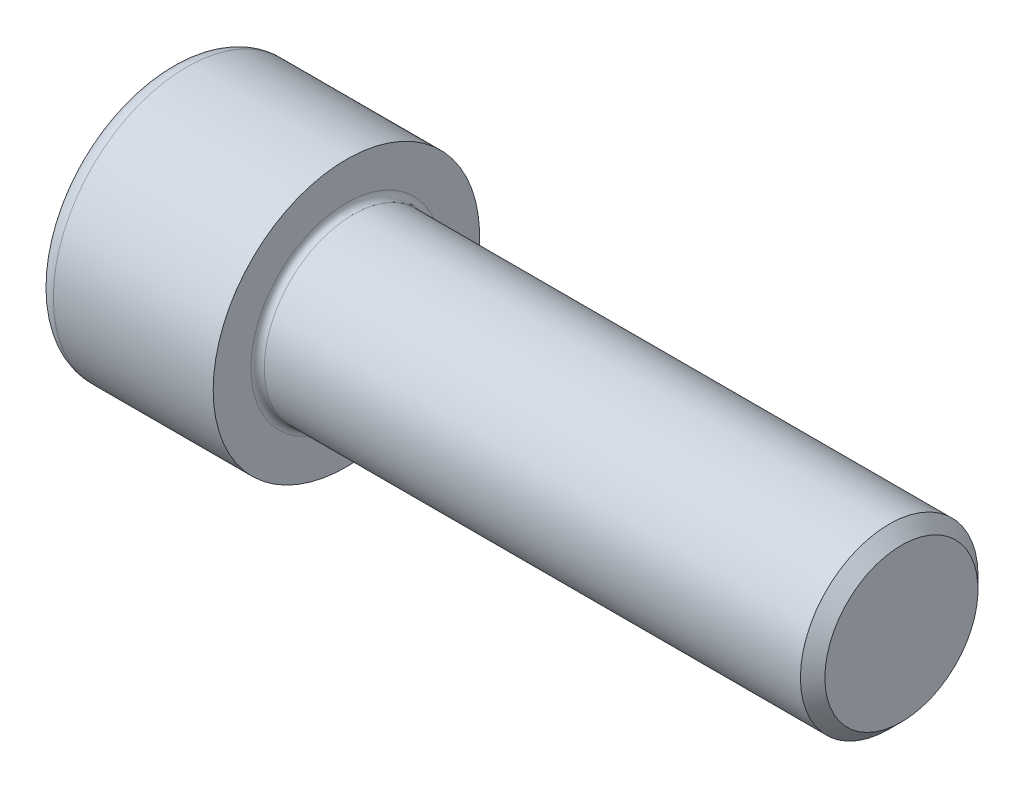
from build123d import *

# Parameters (mm, degrees)
FILLET1_R   = 0.6
FILLET2_R   = 1.6
HEX_2_DEPTH = 8


with BuildPart() as part:
    # BodySke → Base-Revolve (revolve)
    with BuildSketch(Plane.XY, mode=Mode.PRIVATE) as base_revolve_sk:
        Polygon((0, 0), (0, 12), (16, 12), (16, 8), (64.8985, 8), (66, 6.8985), (66, 0), align=None)
    revolve(base_revolve_sk.sketch.rotate(Axis((-31.75, 0, 0), (1, 0, 0)), 90), axis=Axis((-31.75, 0, 0), (1, 0, 0)))

    # Fillet1
    fillet1_edges = [part.edges().sort_by_distance(p)[0] for p in [
        (16, 0, -8),
    ]]
    fillet(fillet1_edges, radius=FILLET1_R)

    # Fillet2
    fillet2_edges = [part.edges().sort_by_distance(p)[0] for p in [
        (0, 0, -12),
    ]]
    fillet(fillet2_edges, radius=FILLET2_R)

    # Sketch2 → Hex-PreBroach (revolve, cut)
    with BuildSketch(Plane.XY, mode=Mode.PRIVATE) as hex_prebroach_sk:
        Polygon((0, 7.016), (8, 7.016), (12.050689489, 0), (0, 0), align=None)
    revolve(hex_prebroach_sk.sketch.rotate(Axis((0, 0, 0), (1, 0, 0)), 90), axis=Axis((0, 0, 0), (1, 0, 0)), mode=Mode.SUBTRACT)

    # Sketch3 → Hex 2 (cut)
    with BuildSketch(Plane(origin=(0, 0, 0), x_dir=(0, 0.500000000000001, 0.866025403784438), z_dir=(-1, 0, 0))):
        Polygon((4.050689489, 7.016), (-4.050689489, 7.016), (-8.101378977, 0), (-4.050689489, -7.016), (4.050689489, -7.016), (8.101378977, 0), align=None)
    extrude(amount=-HEX_2_DEPTH, mode=Mode.SUBTRACT)


solid = part.part
